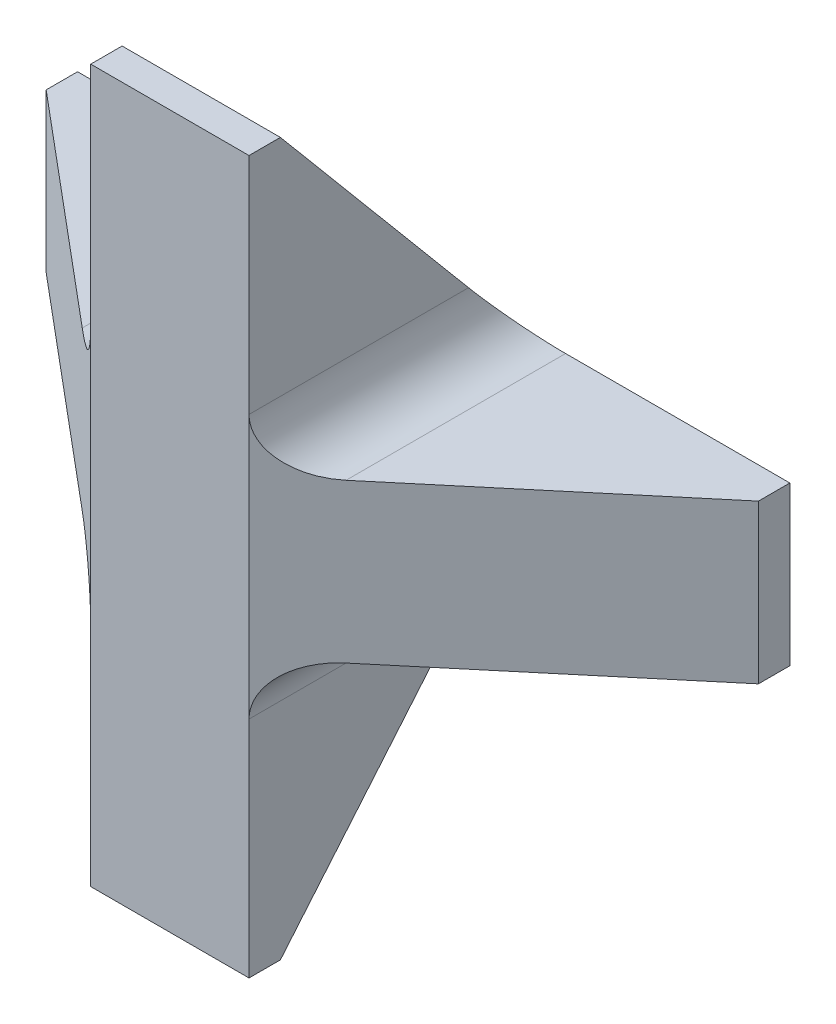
from build123d import *
from OCP.BRepFilletAPI import BRepFilletAPI_MakeChamfer

# Parameters (mm, degrees)
SKETCH1_W           = 13.5
SKETCH1_H           = 5
BOSS_EXTRUDE1_DEPTH = 3
SKETCH2_W           = 3
SKETCH2_H           = 13.5
BOSS_EXTRUDE2_DEPTH = 5
CHAMFER2_SIZE       = 5.25
CHAMFER2_SIZE2      = 4.405273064
FILLET5_R           = 1


with BuildPart() as part:
    # Sketch1 → Boss-Extrude1 (new body)
    with BuildSketch(Plane(origin=(0, 0, 0), x_dir=(1, 0, 0), z_dir=(0, 1, 0))):
        with Locations((6.75, -2.5)):
            Rectangle(SKETCH1_W, SKETCH1_H)
    extrude(amount=BOSS_EXTRUDE1_DEPTH)

    # Sketch2 → Boss-Extrude2 (add)
    with BuildSketch(Plane.XY.offset(5)):
        with Locations((6.75, 1.5)):
            Rectangle(SKETCH2_W, SKETCH2_H)
    extrude(amount=-BOSS_EXTRUDE2_DEPTH)

    # Chamfer2: one chamfer whose edges measure the first distance from different faces: ONE call of the kernel's chamfer builder (chamfer() names one face for all edges)
    chamfer2_edges_1 = [part.edges().sort_by_distance(p)[0] for p in [
        (6.75, 8.25, 0),
        (6.75, -5.25, 0),
    ]]
    chamfer2_side_1 = [part.faces().sort_by_distance(p)[0] for p in [
        (6.75, 1.5, 0),
    ]]
    chamfer2_edges_2 = [part.edges().sort_by_distance(p)[0] for p in [
        (0, 1.5, 5),
        (13.5, 1.5, 5),
    ]]
    chamfer2_side_2 = [part.faces().sort_by_distance(p)[0] for p in [
        (6.75, 1.5, 5),
    ]]
    chamfer2 = BRepFilletAPI_MakeChamfer(part.part.solid().wrapped)
    for e in chamfer2_edges_1:
        chamfer2.Add(CHAMFER2_SIZE, CHAMFER2_SIZE2, e.wrapped, chamfer2_side_1[0].wrapped)  # the first distance lies on this face
    for e in chamfer2_edges_2:
        chamfer2.Add(CHAMFER2_SIZE, CHAMFER2_SIZE2, e.wrapped, chamfer2_side_2[0].wrapped)  # the first distance lies on this face
    add(Compound.cast(chamfer2.Shape()), mode=Mode.REPLACE)

    # Fillet5
    fillet5_edges = [part.edges().sort_by_distance(p)[0] for p in [
        (5.25, 0, 2.5),
        (8.25, 0, 2.5),
        (8.25, 3, 2.5),
        (5.25, 3, 2.5),
    ]]
    fillet(fillet5_edges, radius=FILLET5_R)


solid = part.part
